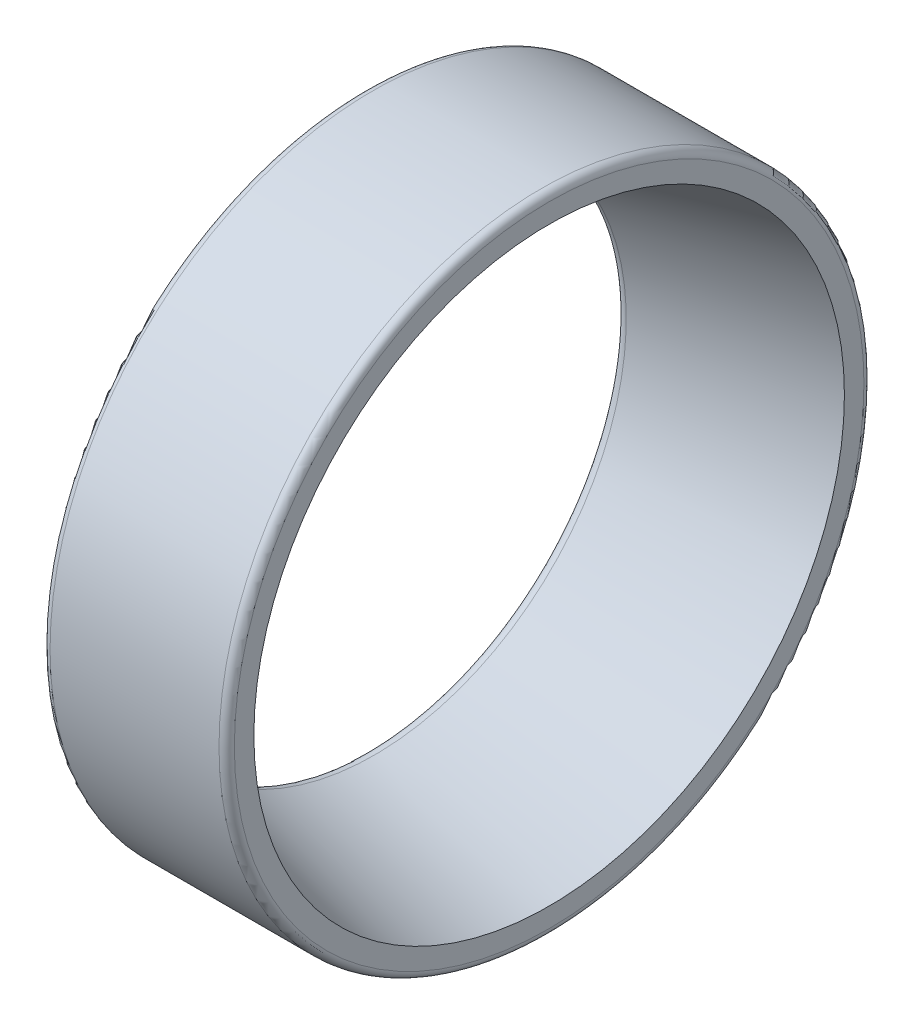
ISO-10303-21;
HEADER;
FILE_DESCRIPTION(('STEP AP214'),'2;1');
FILE_NAME('part.step','',(''),(''),'','','');
FILE_SCHEMA(('AUTOMOTIVE_DESIGN { 1 0 10303 214 1 1 1 1 }'));
ENDSEC;
DATA;
#1=APPLICATION_CONTEXT('core data for automotive mechanical design processes');
#2=APPLICATION_PROTOCOL_DEFINITION('international standard','automotive_design',2000,#1);
#3=PRODUCT_CONTEXT('',#1,'mechanical');
#4=PRODUCT('Part','Part','',(#3));
#5=PRODUCT_RELATED_PRODUCT_CATEGORY('part','',(#4));
#6=PRODUCT_DEFINITION_FORMATION('','',#4);
#7=PRODUCT_DEFINITION_CONTEXT('part definition',#1,'design');
#8=PRODUCT_DEFINITION('design','',#6,#7);
#9=PRODUCT_DEFINITION_SHAPE('','',#8);
#10=(LENGTH_UNIT() NAMED_UNIT(*) SI_UNIT(.MILLI.,.METRE.));
#11=(NAMED_UNIT(*) PLANE_ANGLE_UNIT() SI_UNIT($,.RADIAN.));
#12=(NAMED_UNIT(*) SI_UNIT($,.STERADIAN.) SOLID_ANGLE_UNIT());
#13=UNCERTAINTY_MEASURE_WITH_UNIT(LENGTH_MEASURE(1.E-05),#10,'distance_accuracy_value','');
#14=(GEOMETRIC_REPRESENTATION_CONTEXT(3) GLOBAL_UNCERTAINTY_ASSIGNED_CONTEXT((#13)) GLOBAL_UNIT_ASSIGNED_CONTEXT((#10,
#11,#12)) REPRESENTATION_CONTEXT('',''));
#15=CARTESIAN_POINT('',(0.,0.,0.));
#16=DIRECTION('',(0.,0.,1.));
#17=DIRECTION('',(1.,0.,0.));
#18=AXIS2_PLACEMENT_3D('',#15,#16,#17);
#19=CARTESIAN_POINT('',(0.5,0.,0.));
#20=DIRECTION('',(-1.,0.,0.));
#21=DIRECTION('',(0.,0.,1.));
#22=AXIS2_PLACEMENT_3D('',#19,#20,#21);
#23=TOROIDAL_SURFACE('',#22,16.8871329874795,0.499999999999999);
#24=CARTESIAN_POINT('',(0.620571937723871,0.,0.));
#25=DIRECTION('',(-1.,0.,0.));
#26=DIRECTION('',(0.,0.,1.));
#27=AXIS2_PLACEMENT_3D('',#24,#25,#26);
#28=CIRCLE('',#27,16.40188829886);
#29=CARTESIAN_POINT('',(0.620571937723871,0.,16.40188829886));
#30=VERTEX_POINT('',#29);
#31=EDGE_CURVE('E10',#30,#30,#28,.T.);
#32=ORIENTED_EDGE('',*,*,#31,.F.);
#33=EDGE_LOOP('',(#32));
#34=FACE_BOUND('',#33,.T.);
#35=CARTESIAN_POINT('',(0.,0.,0.));
#36=DIRECTION('',(-1.,0.,0.));
#37=DIRECTION('',(0.,0.,1.));
#38=AXIS2_PLACEMENT_3D('',#35,#36,#37);
#39=CIRCLE('',#38,16.8871329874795);
#40=CARTESIAN_POINT('',(0.,0.,16.8871329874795));
#41=VERTEX_POINT('',#40);
#42=EDGE_CURVE('E54',#41,#41,#39,.T.);
#43=ORIENTED_EDGE('',*,*,#42,.T.);
#44=EDGE_LOOP('',(#43));
#45=FACE_BOUND('',#44,.T.);
#46=ADVANCED_FACE('F29',(#34,#45),#23,.T.);
#47=CARTESIAN_POINT('',(10.9548795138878,0.,0.));
#48=DIRECTION('',(1.,0.,0.));
#49=DIRECTION('',(0.,0.,-1.));
#50=AXIS2_PLACEMENT_3D('',#47,#48,#49);
#51=CONICAL_SURFACE('',#50,18.9697216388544,0.243544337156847);
#52=CARTESIAN_POINT('',(12.,0.,0.));
#53=DIRECTION('',(-1.,0.,0.));
#54=DIRECTION('',(0.,0.,1.));
#55=AXIS2_PLACEMENT_3D('',#52,#53,#54);
#56=CIRCLE('',#55,19.2294095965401);
#57=CARTESIAN_POINT('',(12.,0.,19.2294095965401));
#58=VERTEX_POINT('',#57);
#59=EDGE_CURVE('E35',#58,#58,#56,.T.);
#60=ORIENTED_EDGE('',*,*,#59,.F.);
#61=EDGE_LOOP('',(#60));
#62=FACE_BOUND('',#61,.T.);
#63=ORIENTED_EDGE('',*,*,#31,.T.);
#64=EDGE_LOOP('',(#63));
#65=FACE_BOUND('',#64,.T.);
#66=ADVANCED_FACE('F85',(#62,#65),#51,.F.);
#67=CARTESIAN_POINT('',(12.,0.,-20.5));
#68=DIRECTION('',(-1.,0.,0.));
#69=DIRECTION('',(0.,0.,1.));
#70=AXIS2_PLACEMENT_3D('',#67,#68,#69);
#71=PLANE('',#70);
#72=CARTESIAN_POINT('',(12.,0.,0.));
#73=DIRECTION('',(-1.,0.,0.));
#74=DIRECTION('',(0.,0.,1.));
#75=AXIS2_PLACEMENT_3D('',#72,#73,#74);
#76=CIRCLE('',#75,20.5);
#77=CARTESIAN_POINT('',(12.,0.,20.5));
#78=VERTEX_POINT('',#77);
#79=EDGE_CURVE('E39',#78,#78,#76,.T.);
#80=ORIENTED_EDGE('',*,*,#79,.F.);
#81=EDGE_LOOP('',(#80));
#82=FACE_BOUND('',#81,.T.);
#83=ORIENTED_EDGE('',*,*,#59,.T.);
#84=EDGE_LOOP('',(#83));
#85=FACE_BOUND('',#84,.T.);
#86=ADVANCED_FACE('F80',(#82,#85),#71,.F.);
#87=CARTESIAN_POINT('',(11.5,0.,0.));
#88=DIRECTION('',(-1.,0.,0.));
#89=DIRECTION('',(0.,0.,1.));
#90=AXIS2_PLACEMENT_3D('',#87,#88,#89);
#91=TOROIDAL_SURFACE('',#90,20.5,0.500000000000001);
#92=CARTESIAN_POINT('',(11.5,0.,0.));
#93=DIRECTION('',(-1.,0.,0.));
#94=DIRECTION('',(0.,0.,1.));
#95=AXIS2_PLACEMENT_3D('',#92,#93,#94);
#96=CIRCLE('',#95,21.);
#97=CARTESIAN_POINT('',(11.5,0.,21.));
#98=VERTEX_POINT('',#97);
#99=EDGE_CURVE('E43',#98,#98,#96,.T.);
#100=ORIENTED_EDGE('',*,*,#99,.F.);
#101=EDGE_LOOP('',(#100));
#102=FACE_BOUND('',#101,.T.);
#103=ORIENTED_EDGE('',*,*,#79,.T.);
#104=EDGE_LOOP('',(#103));
#105=FACE_BOUND('',#104,.T.);
#106=ADVANCED_FACE('F74',(#102,#105),#91,.T.);
#107=CARTESIAN_POINT('',(0.,0.,0.));
#108=DIRECTION('',(-1.,0.,0.));
#109=DIRECTION('',(0.,0.,1.));
#110=AXIS2_PLACEMENT_3D('',#107,#108,#109);
#111=CYLINDRICAL_SURFACE('',#110,21.);
#112=CARTESIAN_POINT('',(0.5,0.,0.));
#113=DIRECTION('',(-1.,0.,0.));
#114=DIRECTION('',(0.,0.,1.));
#115=AXIS2_PLACEMENT_3D('',#112,#113,#114);
#116=CIRCLE('',#115,21.);
#117=CARTESIAN_POINT('',(0.5,0.,21.));
#118=VERTEX_POINT('',#117);
#119=EDGE_CURVE('E48',#118,#118,#116,.T.);
#120=ORIENTED_EDGE('',*,*,#119,.F.);
#121=EDGE_LOOP('',(#120));
#122=FACE_BOUND('',#121,.T.);
#123=ORIENTED_EDGE('',*,*,#99,.T.);
#124=EDGE_LOOP('',(#123));
#125=FACE_BOUND('',#124,.T.);
#126=ADVANCED_FACE('F68',(#122,#125),#111,.T.);
#127=CARTESIAN_POINT('',(0.5,0.,0.));
#128=DIRECTION('',(-1.,0.,0.));
#129=DIRECTION('',(0.,0.,1.));
#130=AXIS2_PLACEMENT_3D('',#127,#128,#129);
#131=TOROIDAL_SURFACE('',#130,20.5,0.5);
#132=CARTESIAN_POINT('',(0.,0.,0.));
#133=DIRECTION('',(-1.,0.,0.));
#134=DIRECTION('',(0.,0.,1.));
#135=AXIS2_PLACEMENT_3D('',#132,#133,#134);
#136=CIRCLE('',#135,20.5);
#137=CARTESIAN_POINT('',(0.,0.,20.5));
#138=VERTEX_POINT('',#137);
#139=EDGE_CURVE('E51',#138,#138,#136,.T.);
#140=ORIENTED_EDGE('',*,*,#139,.F.);
#141=EDGE_LOOP('',(#140));
#142=FACE_BOUND('',#141,.T.);
#143=ORIENTED_EDGE('',*,*,#119,.T.);
#144=EDGE_LOOP('',(#143));
#145=FACE_BOUND('',#144,.T.);
#146=ADVANCED_FACE('F62',(#142,#145),#131,.T.);
#147=CARTESIAN_POINT('',(0.,0.,-16.8871329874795));
#148=DIRECTION('',(1.,0.,0.));
#149=DIRECTION('',(0.,0.,-1.));
#150=AXIS2_PLACEMENT_3D('',#147,#148,#149);
#151=PLANE('',#150);
#152=ORIENTED_EDGE('',*,*,#42,.F.);
#153=EDGE_LOOP('',(#152));
#154=FACE_BOUND('',#153,.T.);
#155=ORIENTED_EDGE('',*,*,#139,.T.);
#156=EDGE_LOOP('',(#155));
#157=FACE_BOUND('',#156,.T.);
#158=ADVANCED_FACE('F59',(#154,#157),#151,.F.);
#159=CLOSED_SHELL('',(#46,#66,#86,#106,#126,#146,#158));
#160=MANIFOLD_SOLID_BREP('B2',#159);
#161=ADVANCED_BREP_SHAPE_REPRESENTATION('',(#18,#160),#14);
#162=SHAPE_DEFINITION_REPRESENTATION(#9,#161);
ENDSEC;
END-ISO-10303-21;
